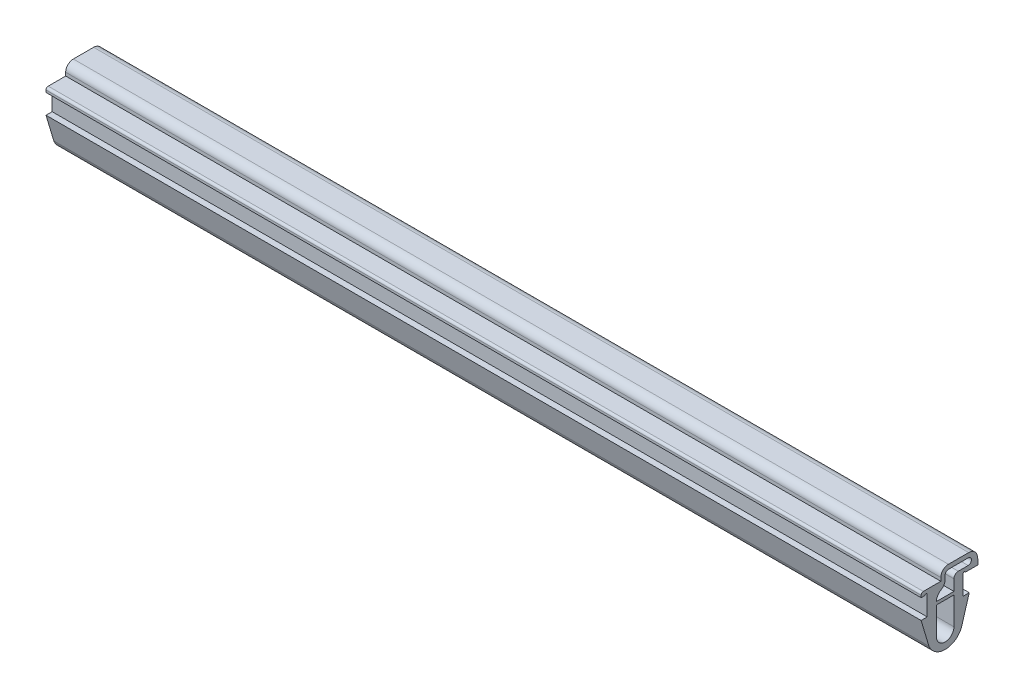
from build123d import *

# Parameters (mm, degrees)
TIIVISTEPROFIILIT_1_6027_TIIVISTEPROFIIL_DEPTH = 200


with BuildPart() as part:
    # Sketch1 → Tiivisteprofiilit 1.6027 TIIVISTEPROFIIL (new body)
    with BuildSketch(Plane(origin=(0, 0, 0), x_dir=(0, 0, -1), z_dir=(1, 0, 0))):
        with BuildLine():
            Line((-6.762210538, 5.053342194), (-6.762210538, 4.553342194))
            Line((-6.762210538, 4.553342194), (-5.862216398, 4.553342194))
            ThreePointArc((-5.862216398, 4.553342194), (-5.612216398, 4.803342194), (-5.362216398, 4.553342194))
            Line((-5.362216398, 4.553342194), (-5.362216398, 0.053342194))
            Line((-5.362216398, 0.053342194), (-6.762210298, 0.053342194))
            Line((-6.762210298, 0.053342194), (-4.978437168, -5.926407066))
            ThreePointArc((-4.978437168, -5.926407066), (-1.262210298, -8.446657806), (2.454016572, -5.926407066))
            Line((2.454016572, -5.926407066), (4.237789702, 0.053342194))
            Line((4.237789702, 0.053342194), (2.837788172, 0.053342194))
            Line((2.837788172, 0.053342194), (2.837795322, 4.553342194))
            ThreePointArc((2.837795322, 4.553342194), (3.087795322, 4.803342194), (3.337795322, 4.553342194))
            Line((3.337795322, 4.553342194), (6.237789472, 4.553342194))
            Line((6.237789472, 4.553342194), (6.237789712, 5.553342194))
            Line((6.237789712, 5.553342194), (6.088388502, 6.400638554))
            ThreePointArc((6.088388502, 6.400638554), (5.404348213, 7.585431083), (4.118772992, 8.053342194))
            Line((4.118772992, 8.053342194), (-0.512210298, 8.053342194))
            ThreePointArc((-0.512210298, 8.053342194), (-1.749647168, 7.540779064), (-2.262210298, 6.303342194))
            Line((-2.262210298, 6.303342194), (-2.262210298, 5.553342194))
            Line((-2.262210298, 5.553342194), (-6.262210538, 5.553342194))
            ThreePointArc((-6.262210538, 5.553342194), (-6.615763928, 5.406895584), (-6.762210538, 5.053342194))
        make_face()
        with BuildLine():
            Line((0.737789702, 4.553342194), (0.737789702, 2.0533422))
            Line((0.737789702, 2.0533422), (-3.262210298, 2.0533422))
            ThreePointArc((-3.262210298, 2.0533422), (-2.994261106, 3.053342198), (-2.262210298, 3.785393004))
            ThreePointArc((-2.262210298, 3.785393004), (-1.530159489, 4.517443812), (-1.262210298, 5.517443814))
            Line((-1.262210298, 5.517443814), (-1.262210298, 6.303342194))
            ThreePointArc((-1.262210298, 6.303342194), (-1.042540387, 6.833672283), (-0.512210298, 7.053342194))
            Line((-0.512210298, 7.053342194), (3.987789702, 7.053342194))
            ThreePointArc((3.987789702, 7.053342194), (4.737789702, 6.303342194), (3.987789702, 5.553342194))
            Line((3.987789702, 5.553342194), (1.737789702, 5.553342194))
            ThreePointArc((1.737789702, 5.553342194), (1.030682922, 5.260448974), (0.737789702, 4.553342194))
        make_face(mode=Mode.SUBTRACT)
        with BuildLine():
            Line((-3.262210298, -4.946657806), (-3.262210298, 1.361878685))
            Line((-3.262210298, 1.361878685), (0.737789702, 1.361878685))
            Line((0.737789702, 1.361878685), (0.737789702, -4.946657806))
            ThreePointArc((0.737789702, -4.946657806), (-1.262210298, -6.946657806), (-3.262210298, -4.946657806))
        make_face(mode=Mode.SUBTRACT)
    extrude(amount=TIIVISTEPROFIILIT_1_6027_TIIVISTEPROFIIL_DEPTH)


solid = part.part
